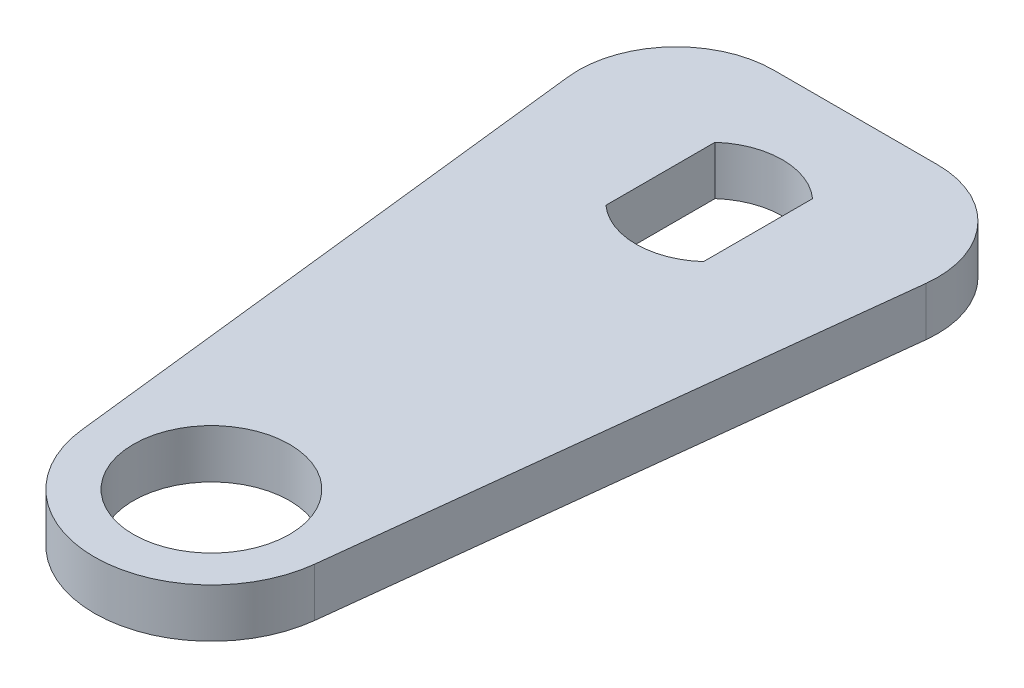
from build123d import *

# Parameters (mm, degrees)
FORME_PI_CE_DEPTH  = 5
CONG_1_R           = 10
ESQUISSE2_R        = 8
PASSAGE_TUBE_DEPTH = 10


with BuildPart() as part:
    # Esquisse1 → Forme pi_ce (new body)
    with BuildSketch(Plane(origin=(0, 0, 0), x_dir=(1, 0, 0), z_dir=(0, 1, 0))):
        with BuildLine():
            Line((-11.922862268, -52.358438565), (-19.59738694, 15))
            Line((-19.59738694, 15), (19.59738694, 15))
            Line((19.59738694, 15), (11.922862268, -52.358438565))
            ThreePointArc((11.922862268, -52.358438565), (0, -63), (-11.922862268, -52.358438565))
        make_face()
        with BuildLine():
            Line((-5, 5.590169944), (-5, -5.590169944))
            ThreePointArc((-5, -5.590169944), (0, -7.5), (5, -5.590169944))
            Line((5, -5.590169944), (5, 5.590169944))
            ThreePointArc((5, 5.590169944), (0, 7.5), (-5, 5.590169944))
        make_face(mode=Mode.SUBTRACT)
    extrude(amount=FORME_PI_CE_DEPTH)

    # Cong_1
    cong_1_edges = [part.edges().sort_by_distance(p)[0] for p in [
        (-19.59738694, 2.5, -15),
        (19.59738694, 2.5, -15),
    ]]
    fillet(cong_1_edges, radius=CONG_1_R)

    # Esquisse2 → passage tube (cut)
    with BuildSketch(Plane.XZ):
        with Locations(Location((0, 51, 0), (0, 0, 270))):
            Circle(ESQUISSE2_R)
    extrude(amount=-PASSAGE_TUBE_DEPTH, mode=Mode.SUBTRACT)


solid = part.part
